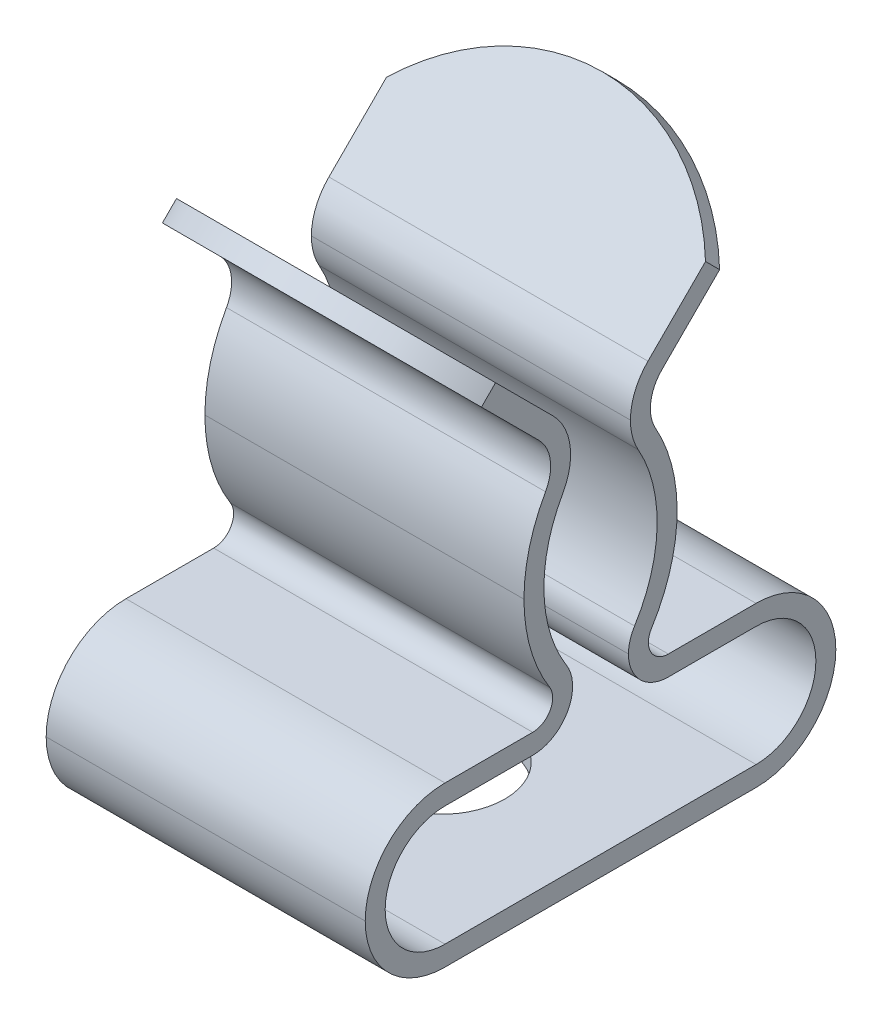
ISO-10303-21;
HEADER;
FILE_DESCRIPTION(('STEP AP214'),'2;1');
FILE_NAME('part.step','',(''),(''),'','','');
FILE_SCHEMA(('AUTOMOTIVE_DESIGN { 1 0 10303 214 1 1 1 1 }'));
ENDSEC;
DATA;
#1=APPLICATION_CONTEXT('core data for automotive mechanical design processes');
#2=APPLICATION_PROTOCOL_DEFINITION('international standard','automotive_design',2000,#1);
#3=PRODUCT_CONTEXT('',#1,'mechanical');
#4=PRODUCT('Part','Part','',(#3));
#5=PRODUCT_RELATED_PRODUCT_CATEGORY('part','',(#4));
#6=PRODUCT_DEFINITION_FORMATION('','',#4);
#7=PRODUCT_DEFINITION_CONTEXT('part definition',#1,'design');
#8=PRODUCT_DEFINITION('design','',#6,#7);
#9=PRODUCT_DEFINITION_SHAPE('','',#8);
#10=(LENGTH_UNIT() NAMED_UNIT(*) SI_UNIT(.MILLI.,.METRE.));
#11=(NAMED_UNIT(*) PLANE_ANGLE_UNIT() SI_UNIT($,.RADIAN.));
#12=(NAMED_UNIT(*) SI_UNIT($,.STERADIAN.) SOLID_ANGLE_UNIT());
#13=UNCERTAINTY_MEASURE_WITH_UNIT(LENGTH_MEASURE(1.E-05),#10,'distance_accuracy_value','');
#14=(GEOMETRIC_REPRESENTATION_CONTEXT(3) GLOBAL_UNCERTAINTY_ASSIGNED_CONTEXT((#13)) GLOBAL_UNIT_ASSIGNED_CONTEXT((#10,
#11,#12)) REPRESENTATION_CONTEXT('',''));
#15=CARTESIAN_POINT('',(0.,0.,0.));
#16=DIRECTION('',(0.,0.,1.));
#17=DIRECTION('',(1.,0.,0.));
#18=AXIS2_PLACEMENT_3D('',#15,#16,#17);
#19=CARTESIAN_POINT('',(17.3911017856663,15.2171733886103,17.2699844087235));
#20=DIRECTION('',(0.,-1.,0.));
#21=DIRECTION('',(-1.,0.,0.));
#22=AXIS2_PLACEMENT_3D('',#19,#20,#21);
#23=CYLINDRICAL_SURFACE('',#22,1.6);
#24=DIRECTION('',(0.,-1.,0.));
#25=VECTOR('',#24,1.);
#26=CARTESIAN_POINT('',(18.9911017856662,15.2171733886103,17.2699844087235));
#27=LINE('',#26,#25);
#28=CARTESIAN_POINT('',(18.9911017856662,15.7171733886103,17.2699844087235));
#29=VERTEX_POINT('',#28);
#30=CARTESIAN_POINT('',(18.9911017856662,15.2171733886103,17.2699844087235));
#31=VERTEX_POINT('',#30);
#32=EDGE_CURVE('E1331',#29,#31,#27,.T.);
#33=ORIENTED_EDGE('',*,*,#32,.F.);
#34=CARTESIAN_POINT('',(17.3911017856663,15.7171733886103,17.2699844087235));
#35=DIRECTION('',(0.,1.,0.));
#36=DIRECTION('',(1.,0.,0.));
#37=AXIS2_PLACEMENT_3D('',#34,#35,#36);
#38=CIRCLE('',#37,1.6);
#39=CARTESIAN_POINT('',(15.7911017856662,15.7171733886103,17.2699844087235));
#40=VERTEX_POINT('',#39);
#41=EDGE_CURVE('E698',#29,#40,#38,.T.);
#42=ORIENTED_EDGE('',*,*,#41,.T.);
#43=DIRECTION('',(0.,-1.,0.));
#44=VECTOR('',#43,1.);
#45=CARTESIAN_POINT('',(15.7911017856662,15.2171733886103,17.2699844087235));
#46=LINE('',#45,#44);
#47=CARTESIAN_POINT('',(15.7911017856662,15.2171733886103,17.2699844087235));
#48=VERTEX_POINT('',#47);
#49=EDGE_CURVE('E1267',#40,#48,#46,.T.);
#50=ORIENTED_EDGE('',*,*,#49,.T.);
#51=CARTESIAN_POINT('',(17.3911017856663,15.2171733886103,17.2699844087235));
#52=DIRECTION('',(0.,-1.,0.));
#53=DIRECTION('',(-1.,0.,0.));
#54=AXIS2_PLACEMENT_3D('',#51,#52,#53);
#55=CIRCLE('',#54,1.6);
#56=EDGE_CURVE('E558',#48,#31,#55,.T.);
#57=ORIENTED_EDGE('',*,*,#56,.T.);
#58=EDGE_LOOP('',(#33,#42,#50,#57));
#59=FACE_BOUND('',#58,.T.);
#60=ADVANCED_FACE('F15',(#59),#23,.F.);
#61=CARTESIAN_POINT('',(17.3911017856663,30.1259717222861,12.8076738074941));
#62=DIRECTION('',(0.,-0.70710678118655,0.707106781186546));
#63=DIRECTION('',(0.,-0.707106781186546,-0.70710678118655));
#64=AXIS2_PLACEMENT_3D('',#61,#62,#63);
#65=CYLINDRICAL_SURFACE('',#64,5.);
#66=CARTESIAN_POINT('',(17.3911017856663,25.1527484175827,17.7808971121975));
#67=DIRECTION('',(0.,-0.707106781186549,0.707106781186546));
#68=DIRECTION('',(0.,0.707106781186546,0.707106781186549));
#69=AXIS2_PLACEMENT_3D('',#66,#67,#68);
#70=CIRCLE('',#69,5.);
#71=CARTESIAN_POINT('',(21.3911017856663,27.2740687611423,19.9022174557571));
#72=VERTEX_POINT('',#71);
#73=CARTESIAN_POINT('',(13.3911017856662,27.2740687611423,19.9022174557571));
#74=VERTEX_POINT('',#73);
#75=EDGE_CURVE('E390',#72,#74,#70,.T.);
#76=ORIENTED_EDGE('',*,*,#75,.T.);
#77=DIRECTION('',(0.,-0.707106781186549,0.707106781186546));
#78=VECTOR('',#77,1.);
#79=CARTESIAN_POINT('',(13.3911017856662,32.2472920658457,14.9289941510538));
#80=LINE('',#79,#78);
#81=CARTESIAN_POINT('',(13.3911017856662,26.920515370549,20.2557708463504));
#82=VERTEX_POINT('',#81);
#83=EDGE_CURVE('E370',#74,#82,#80,.T.);
#84=ORIENTED_EDGE('',*,*,#83,.T.);
#85=CARTESIAN_POINT('',(17.3911017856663,24.7991950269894,18.1344505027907));
#86=DIRECTION('',(0.,0.70710678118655,-0.707106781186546));
#87=DIRECTION('',(0.,-0.707106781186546,-0.70710678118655));
#88=AXIS2_PLACEMENT_3D('',#85,#86,#87);
#89=CIRCLE('',#88,5.);
#90=CARTESIAN_POINT('',(21.3911017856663,26.920515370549,20.2557708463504));
#91=VERTEX_POINT('',#90);
#92=EDGE_CURVE('E421',#82,#91,#89,.T.);
#93=ORIENTED_EDGE('',*,*,#92,.T.);
#94=DIRECTION('',(0.,-0.707106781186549,0.707106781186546));
#95=VECTOR('',#94,1.);
#96=CARTESIAN_POINT('',(21.3911017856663,32.2472920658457,14.9289941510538));
#97=LINE('',#96,#95);
#98=EDGE_CURVE('E575',#72,#91,#97,.T.);
#99=ORIENTED_EDGE('',*,*,#98,.F.);
#100=EDGE_LOOP('',(#76,#84,#93,#99));
#101=FACE_BOUND('',#100,.T.);
#102=ADVANCED_FACE('F17',(#101),#65,.T.);
#103=CARTESIAN_POINT('',(17.3911017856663,30.1259717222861,21.7322950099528));
#104=DIRECTION('',(0.,-0.70710678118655,-0.707106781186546));
#105=DIRECTION('',(0.,0.707106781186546,-0.70710678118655));
#106=AXIS2_PLACEMENT_3D('',#103,#104,#105);
#107=CYLINDRICAL_SURFACE('',#106,5.);
#108=DIRECTION('',(0.,-0.707106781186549,-0.707106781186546));
#109=VECTOR('',#108,1.);
#110=CARTESIAN_POINT('',(17.3911017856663,33.6615056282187,18.1967611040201));
#111=LINE('',#110,#109);
#112=CARTESIAN_POINT('',(17.3911017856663,28.6882823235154,13.2235377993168));
#113=VERTEX_POINT('',#112);
#114=CARTESIAN_POINT('',(17.3911017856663,28.3347289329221,12.8699844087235));
#115=VERTEX_POINT('',#114);
#116=EDGE_CURVE('E1274',#113,#115,#111,.T.);
#117=ORIENTED_EDGE('',*,*,#116,.F.);
#118=CARTESIAN_POINT('',(17.3911017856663,25.1527484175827,16.7590717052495));
#119=DIRECTION('',(0.,-0.707106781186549,-0.707106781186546));
#120=DIRECTION('',(0.,-0.707106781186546,0.707106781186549));
#121=AXIS2_PLACEMENT_3D('',#118,#119,#120);
#122=CIRCLE('',#121,5.);
#123=CARTESIAN_POINT('',(21.3911017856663,27.2740687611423,14.6377513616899));
#124=VERTEX_POINT('',#123);
#125=EDGE_CURVE('E410',#113,#124,#122,.T.);
#126=ORIENTED_EDGE('',*,*,#125,.T.);
#127=DIRECTION('',(0.,-0.707106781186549,-0.707106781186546));
#128=VECTOR('',#127,1.);
#129=CARTESIAN_POINT('',(21.3911017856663,32.2472920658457,19.6109746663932));
#130=LINE('',#129,#128);
#131=CARTESIAN_POINT('',(21.3911017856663,26.920515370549,14.2841979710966));
#132=VERTEX_POINT('',#131);
#133=EDGE_CURVE('E482',#124,#132,#130,.T.);
#134=ORIENTED_EDGE('',*,*,#133,.T.);
#135=CARTESIAN_POINT('',(17.3911017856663,24.7991950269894,16.4055183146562));
#136=DIRECTION('',(0.,0.70710678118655,0.707106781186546));
#137=DIRECTION('',(0.,-0.707106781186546,0.70710678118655));
#138=AXIS2_PLACEMENT_3D('',#135,#136,#137);
#139=CIRCLE('',#138,5.);
#140=EDGE_CURVE('E659',#132,#115,#139,.T.);
#141=ORIENTED_EDGE('',*,*,#140,.T.);
#142=EDGE_LOOP('',(#117,#126,#134,#141));
#143=FACE_BOUND('',#142,.T.);
#144=ADVANCED_FACE('F810',(#143),#107,.T.);
#145=CARTESIAN_POINT('',(21.3911017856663,24.770515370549,15.0199844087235));
#146=DIRECTION('',(-1.,0.,0.));
#147=DIRECTION('',(0.,0.,1.));
#148=AXIS2_PLACEMENT_3D('',#145,#146,#147);
#149=CYLINDRICAL_SURFACE('',#148,1.);
#150=DIRECTION('',(-1.,0.,0.));
#151=VECTOR('',#150,1.);
#152=CARTESIAN_POINT('',(21.3911017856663,24.770515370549,16.0199844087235));
#153=LINE('',#152,#151);
#154=CARTESIAN_POINT('',(21.3911017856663,24.770515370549,16.0199844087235));
#155=VERTEX_POINT('',#154);
#156=CARTESIAN_POINT('',(13.3911017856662,24.770515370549,16.0199844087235));
#157=VERTEX_POINT('',#156);
#158=EDGE_CURVE('E1234',#155,#157,#153,.T.);
#159=ORIENTED_EDGE('',*,*,#158,.F.);
#160=CARTESIAN_POINT('',(21.3911017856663,24.770515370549,15.0199844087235));
#161=DIRECTION('',(-1.,0.,0.));
#162=DIRECTION('',(0.,0.,1.));
#163=AXIS2_PLACEMENT_3D('',#160,#161,#162);
#164=CIRCLE('',#163,1.);
#165=CARTESIAN_POINT('',(21.3911017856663,24.27948806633,15.8911285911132));
#166=VERTEX_POINT('',#165);
#167=EDGE_CURVE('E483',#166,#155,#164,.T.);
#168=ORIENTED_EDGE('',*,*,#167,.F.);
#169=DIRECTION('',(-1.,0.,0.));
#170=VECTOR('',#169,1.);
#171=CARTESIAN_POINT('',(21.3911017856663,24.27948806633,15.8911285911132));
#172=LINE('',#171,#170);
#173=CARTESIAN_POINT('',(13.3911017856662,24.27948806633,15.8911285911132));
#174=VERTEX_POINT('',#173);
#175=EDGE_CURVE('E10',#166,#174,#172,.T.);
#176=ORIENTED_EDGE('',*,*,#175,.T.);
#177=CARTESIAN_POINT('',(13.3911017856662,24.770515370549,15.0199844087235));
#178=DIRECTION('',(-1.,0.,0.));
#179=DIRECTION('',(0.,0.,1.));
#180=AXIS2_PLACEMENT_3D('',#177,#178,#179);
#181=CIRCLE('',#180,1.);
#182=EDGE_CURVE('E552',#174,#157,#181,.T.);
#183=ORIENTED_EDGE('',*,*,#182,.T.);
#184=EDGE_LOOP('',(#159,#168,#176,#183));
#185=FACE_BOUND('',#184,.T.);
#186=ADVANCED_FACE('F804',(#185),#149,.F.);
#187=CARTESIAN_POINT('',(21.3911017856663,22.2171733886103,19.54993415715));
#188=DIRECTION('',(-1.,0.,0.));
#189=DIRECTION('',(0.,0.,1.));
#190=AXIS2_PLACEMENT_3D('',#187,#188,#189);
#191=CYLINDRICAL_SURFACE('',#190,4.2);
#192=CARTESIAN_POINT('',(13.3911017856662,22.2171733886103,19.54993415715));
#193=DIRECTION('',(1.,0.,0.));
#194=DIRECTION('',(0.,0.,-1.));
#195=AXIS2_PLACEMENT_3D('',#192,#193,#194);
#196=CIRCLE('',#195,4.2);
#197=CARTESIAN_POINT('',(13.3911017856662,19.9831308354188,15.9933833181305));
#198=VERTEX_POINT('',#197);
#199=EDGE_CURVE('E548',#198,#174,#196,.T.);
#200=ORIENTED_EDGE('',*,*,#199,.T.);
#201=ORIENTED_EDGE('',*,*,#175,.F.);
#202=CARTESIAN_POINT('',(21.3911017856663,22.2171733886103,19.54993415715));
#203=DIRECTION('',(1.,0.,0.));
#204=DIRECTION('',(0.,0.,-1.));
#205=AXIS2_PLACEMENT_3D('',#202,#203,#204);
#206=CIRCLE('',#205,4.2);
#207=CARTESIAN_POINT('',(21.3911017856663,19.9831308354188,15.9933833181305));
#208=VERTEX_POINT('',#207);
#209=EDGE_CURVE('E474',#208,#166,#206,.T.);
#210=ORIENTED_EDGE('',*,*,#209,.F.);
#211=DIRECTION('',(-1.,0.,0.));
#212=VECTOR('',#211,1.);
#213=CARTESIAN_POINT('',(21.3911017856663,19.9831308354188,15.9933833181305));
#214=LINE('',#213,#212);
#215=EDGE_CURVE('E404',#208,#198,#214,.T.);
#216=ORIENTED_EDGE('',*,*,#215,.T.);
#217=EDGE_LOOP('',(#200,#201,#210,#216));
#218=FACE_BOUND('',#217,.T.);
#219=ADVANCED_FACE('F809',(#218),#191,.T.);
#220=CARTESIAN_POINT('',(21.3911017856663,19.7171733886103,15.5699844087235));
#221=DIRECTION('',(-1.,0.,0.));
#222=DIRECTION('',(0.,0.,1.));
#223=AXIS2_PLACEMENT_3D('',#220,#221,#222);
#224=CYLINDRICAL_SURFACE('',#223,0.5);
#225=DIRECTION('',(-1.,0.,0.));
#226=VECTOR('',#225,1.);
#227=CARTESIAN_POINT('',(21.3911017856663,19.7171733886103,16.0699844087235));
#228=LINE('',#227,#226);
#229=CARTESIAN_POINT('',(21.3911017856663,19.7171733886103,16.0699844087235));
#230=VERTEX_POINT('',#229);
#231=CARTESIAN_POINT('',(13.3911017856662,19.7171733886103,16.0699844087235));
#232=VERTEX_POINT('',#231);
#233=EDGE_CURVE('E399',#230,#232,#228,.T.);
#234=ORIENTED_EDGE('',*,*,#233,.F.);
#235=CARTESIAN_POINT('',(21.3911017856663,19.7171733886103,15.5699844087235));
#236=DIRECTION('',(-1.,0.,0.));
#237=DIRECTION('',(0.,0.,1.));
#238=AXIS2_PLACEMENT_3D('',#235,#236,#237);
#239=CIRCLE('',#238,0.5);
#240=CARTESIAN_POINT('',(21.3911017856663,19.2171733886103,15.5699844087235));
#241=VERTEX_POINT('',#240);
#242=EDGE_CURVE('E469',#241,#230,#239,.T.);
#243=ORIENTED_EDGE('',*,*,#242,.F.);
#244=DIRECTION('',(-1.,0.,0.));
#245=VECTOR('',#244,1.);
#246=CARTESIAN_POINT('',(21.3911017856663,19.2171733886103,15.5699844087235));
#247=LINE('',#246,#245);
#248=CARTESIAN_POINT('',(13.3911017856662,19.2171733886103,15.5699844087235));
#249=VERTEX_POINT('',#248);
#250=EDGE_CURVE('E25',#241,#249,#247,.T.);
#251=ORIENTED_EDGE('',*,*,#250,.T.);
#252=CARTESIAN_POINT('',(13.3911017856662,19.7171733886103,15.5699844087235));
#253=DIRECTION('',(-1.,0.,0.));
#254=DIRECTION('',(0.,0.,1.));
#255=AXIS2_PLACEMENT_3D('',#252,#253,#254);
#256=CIRCLE('',#255,0.5);
#257=EDGE_CURVE('E551',#249,#232,#256,.T.);
#258=ORIENTED_EDGE('',*,*,#257,.T.);
#259=EDGE_LOOP('',(#234,#243,#251,#258));
#260=FACE_BOUND('',#259,.T.);
#261=ADVANCED_FACE('F1080',(#260),#224,.F.);
#262=CARTESIAN_POINT('',(21.3911017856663,19.2171733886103,13.3699844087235));
#263=DIRECTION('',(0.,-1.,0.));
#264=DIRECTION('',(-1.,0.,0.));
#265=AXIS2_PLACEMENT_3D('',#262,#263,#264);
#266=PLANE('',#265);
#267=DIRECTION('',(0.,0.,1.));
#268=VECTOR('',#267,1.);
#269=CARTESIAN_POINT('',(13.3911017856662,19.2171733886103,13.3699844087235));
#270=LINE('',#269,#268);
#271=CARTESIAN_POINT('',(13.3911017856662,19.2171733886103,13.3699844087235));
#272=VERTEX_POINT('',#271);
#273=EDGE_CURVE('E645',#272,#249,#270,.T.);
#274=ORIENTED_EDGE('',*,*,#273,.T.);
#275=ORIENTED_EDGE('',*,*,#250,.F.);
#276=DIRECTION('',(0.,0.,1.));
#277=VECTOR('',#276,1.);
#278=CARTESIAN_POINT('',(21.3911017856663,19.2171733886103,13.3699844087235));
#279=LINE('',#278,#277);
#280=CARTESIAN_POINT('',(21.3911017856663,19.2171733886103,13.3699844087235));
#281=VERTEX_POINT('',#280);
#282=EDGE_CURVE('E459',#281,#241,#279,.T.);
#283=ORIENTED_EDGE('',*,*,#282,.F.);
#284=DIRECTION('',(-1.,0.,0.));
#285=VECTOR('',#284,1.);
#286=CARTESIAN_POINT('',(21.3911017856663,19.2171733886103,13.3699844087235));
#287=LINE('',#286,#285);
#288=EDGE_CURVE('E556',#281,#272,#287,.T.);
#289=ORIENTED_EDGE('',*,*,#288,.T.);
#290=EDGE_LOOP('',(#274,#275,#283,#289));
#291=FACE_BOUND('',#290,.T.);
#292=ADVANCED_FACE('F1070',(#291),#266,.F.);
#293=CARTESIAN_POINT('',(21.3911017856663,17.2171733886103,13.3699844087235));
#294=DIRECTION('',(-1.,0.,0.));
#295=DIRECTION('',(0.,0.,1.));
#296=AXIS2_PLACEMENT_3D('',#293,#294,#295);
#297=CYLINDRICAL_SURFACE('',#296,2.);
#298=CARTESIAN_POINT('',(13.3911017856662,17.2171733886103,13.3699844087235));
#299=DIRECTION('',(1.,0.,0.));
#300=DIRECTION('',(0.,0.,-1.));
#301=AXIS2_PLACEMENT_3D('',#298,#299,#300);
#302=CIRCLE('',#301,2.);
#303=CARTESIAN_POINT('',(13.3911017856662,15.2171733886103,13.3699844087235));
#304=VERTEX_POINT('',#303);
#305=EDGE_CURVE('E652',#304,#272,#302,.T.);
#306=ORIENTED_EDGE('',*,*,#305,.T.);
#307=ORIENTED_EDGE('',*,*,#288,.F.);
#308=CARTESIAN_POINT('',(21.3911017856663,17.2171733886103,13.3699844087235));
#309=DIRECTION('',(1.,0.,0.));
#310=DIRECTION('',(0.,0.,-1.));
#311=AXIS2_PLACEMENT_3D('',#308,#309,#310);
#312=CIRCLE('',#311,2.);
#313=CARTESIAN_POINT('',(21.3911017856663,15.2171733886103,13.3699844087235));
#314=VERTEX_POINT('',#313);
#315=EDGE_CURVE('E455',#314,#281,#312,.T.);
#316=ORIENTED_EDGE('',*,*,#315,.F.);
#317=DIRECTION('',(-1.,0.,0.));
#318=VECTOR('',#317,1.);
#319=CARTESIAN_POINT('',(21.3911017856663,15.2171733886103,13.3699844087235));
#320=LINE('',#319,#318);
#321=EDGE_CURVE('E597',#314,#304,#320,.T.);
#322=ORIENTED_EDGE('',*,*,#321,.T.);
#323=EDGE_LOOP('',(#306,#307,#316,#322));
#324=FACE_BOUND('',#323,.T.);
#325=ADVANCED_FACE('F1060',(#324),#297,.T.);
#326=CARTESIAN_POINT('',(21.3911017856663,15.2171733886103,13.3699844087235));
#327=DIRECTION('',(0.,1.,0.));
#328=DIRECTION('',(0.,0.,-1.));
#329=AXIS2_PLACEMENT_3D('',#326,#327,#328);
#330=PLANE('',#329);
#331=ORIENTED_EDGE('',*,*,#56,.F.);
#332=CARTESIAN_POINT('',(17.3911017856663,15.2171733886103,17.2699844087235));
#333=DIRECTION('',(0.,-1.,0.));
#334=DIRECTION('',(-1.,0.,0.));
#335=AXIS2_PLACEMENT_3D('',#332,#333,#334);
#336=CIRCLE('',#335,1.6);
#337=EDGE_CURVE('E1266',#31,#48,#336,.T.);
#338=ORIENTED_EDGE('',*,*,#337,.F.);
#339=EDGE_LOOP('',(#331,#338));
#340=FACE_BOUND('',#339,.T.);
#341=DIRECTION('',(0.,0.,-1.));
#342=VECTOR('',#341,1.);
#343=CARTESIAN_POINT('',(13.3911017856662,15.2171733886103,13.3699844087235));
#344=LINE('',#343,#342);
#345=CARTESIAN_POINT('',(13.3911017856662,15.2171733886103,21.1699844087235));
#346=VERTEX_POINT('',#345);
#347=EDGE_CURVE('E682',#346,#304,#344,.T.);
#348=ORIENTED_EDGE('',*,*,#347,.T.);
#349=ORIENTED_EDGE('',*,*,#321,.F.);
#350=DIRECTION('',(0.,0.,-1.));
#351=VECTOR('',#350,1.);
#352=CARTESIAN_POINT('',(21.3911017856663,15.2171733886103,13.3699844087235));
#353=LINE('',#352,#351);
#354=CARTESIAN_POINT('',(21.3911017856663,15.2171733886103,21.1699844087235));
#355=VERTEX_POINT('',#354);
#356=EDGE_CURVE('E460',#355,#314,#353,.T.);
#357=ORIENTED_EDGE('',*,*,#356,.F.);
#358=DIRECTION('',(-1.,0.,0.));
#359=VECTOR('',#358,1.);
#360=CARTESIAN_POINT('',(21.3911017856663,15.2171733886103,21.1699844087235));
#361=LINE('',#360,#359);
#362=EDGE_CURVE('E429',#355,#346,#361,.T.);
#363=ORIENTED_EDGE('',*,*,#362,.T.);
#364=EDGE_LOOP('',(#348,#349,#357,#363));
#365=FACE_BOUND('',#364,.T.);
#366=ADVANCED_FACE('F1050',(#340,#365),#330,.F.);
#367=CARTESIAN_POINT('',(21.3911017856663,17.2171733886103,21.1699844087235));
#368=DIRECTION('',(-1.,0.,0.));
#369=DIRECTION('',(0.,0.,1.));
#370=AXIS2_PLACEMENT_3D('',#367,#368,#369);
#371=CYLINDRICAL_SURFACE('',#370,2.);
#372=DIRECTION('',(-1.,0.,0.));
#373=VECTOR('',#372,1.);
#374=CARTESIAN_POINT('',(21.3911017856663,17.2171733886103,23.1699844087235));
#375=LINE('',#374,#373);
#376=CARTESIAN_POINT('',(21.3911017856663,17.2171733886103,23.1699844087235));
#377=VERTEX_POINT('',#376);
#378=CARTESIAN_POINT('',(13.3911017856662,17.2171733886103,23.1699844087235));
#379=VERTEX_POINT('',#378);
#380=EDGE_CURVE('E417',#377,#379,#375,.T.);
#381=ORIENTED_EDGE('',*,*,#380,.F.);
#382=CARTESIAN_POINT('',(21.3911017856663,17.2171733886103,21.1699844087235));
#383=DIRECTION('',(1.,0.,0.));
#384=DIRECTION('',(0.,0.,1.));
#385=AXIS2_PLACEMENT_3D('',#382,#383,#384);
#386=CIRCLE('',#385,2.);
#387=CARTESIAN_POINT('',(21.3911017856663,19.2171733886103,21.1699844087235));
#388=VERTEX_POINT('',#387);
#389=EDGE_CURVE('E596',#388,#377,#386,.T.);
#390=ORIENTED_EDGE('',*,*,#389,.F.);
#391=DIRECTION('',(-1.,0.,0.));
#392=VECTOR('',#391,1.);
#393=CARTESIAN_POINT('',(21.3911017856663,19.2171733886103,21.1699844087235));
#394=LINE('',#393,#392);
#395=CARTESIAN_POINT('',(13.3911017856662,19.2171733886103,21.1699844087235));
#396=VERTEX_POINT('',#395);
#397=EDGE_CURVE('E600',#388,#396,#394,.T.);
#398=ORIENTED_EDGE('',*,*,#397,.T.);
#399=CARTESIAN_POINT('',(13.3911017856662,17.2171733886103,21.1699844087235));
#400=DIRECTION('',(1.,0.,0.));
#401=DIRECTION('',(0.,0.,1.));
#402=AXIS2_PLACEMENT_3D('',#399,#400,#401);
#403=CIRCLE('',#402,2.);
#404=EDGE_CURVE('E686',#396,#379,#403,.T.);
#405=ORIENTED_EDGE('',*,*,#404,.T.);
#406=EDGE_LOOP('',(#381,#390,#398,#405));
#407=FACE_BOUND('',#406,.T.);
#408=ADVANCED_FACE('F1040',(#407),#371,.T.);
#409=CARTESIAN_POINT('',(21.3911017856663,19.2171733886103,21.1699844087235));
#410=DIRECTION('',(0.,-1.,0.));
#411=DIRECTION('',(0.,0.,1.));
#412=AXIS2_PLACEMENT_3D('',#409,#410,#411);
#413=PLANE('',#412);
#414=DIRECTION('',(0.,0.,1.));
#415=VECTOR('',#414,1.);
#416=CARTESIAN_POINT('',(13.3911017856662,19.2171733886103,21.1699844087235));
#417=LINE('',#416,#415);
#418=CARTESIAN_POINT('',(13.3911017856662,19.2171733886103,18.9699844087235));
#419=VERTEX_POINT('',#418);
#420=EDGE_CURVE('E635',#419,#396,#417,.T.);
#421=ORIENTED_EDGE('',*,*,#420,.T.);
#422=ORIENTED_EDGE('',*,*,#397,.F.);
#423=DIRECTION('',(0.,0.,1.));
#424=VECTOR('',#423,1.);
#425=CARTESIAN_POINT('',(21.3911017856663,19.2171733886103,21.1699844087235));
#426=LINE('',#425,#424);
#427=CARTESIAN_POINT('',(21.3911017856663,19.2171733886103,18.9699844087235));
#428=VERTEX_POINT('',#427);
#429=EDGE_CURVE('E592',#428,#388,#426,.T.);
#430=ORIENTED_EDGE('',*,*,#429,.F.);
#431=DIRECTION('',(-1.,0.,0.));
#432=VECTOR('',#431,1.);
#433=CARTESIAN_POINT('',(21.3911017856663,19.2171733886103,18.9699844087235));
#434=LINE('',#433,#432);
#435=EDGE_CURVE('E530',#428,#419,#434,.T.);
#436=ORIENTED_EDGE('',*,*,#435,.T.);
#437=EDGE_LOOP('',(#421,#422,#430,#436));
#438=FACE_BOUND('',#437,.T.);
#439=ADVANCED_FACE('F1030',(#438),#413,.F.);
#440=CARTESIAN_POINT('',(21.3911017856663,19.7171733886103,18.9699844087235));
#441=DIRECTION('',(-1.,0.,0.));
#442=DIRECTION('',(0.,0.,1.));
#443=AXIS2_PLACEMENT_3D('',#440,#441,#442);
#444=CYLINDRICAL_SURFACE('',#443,0.5);
#445=CARTESIAN_POINT('',(13.3911017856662,19.7171733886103,18.9699844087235));
#446=DIRECTION('',(-1.,0.,0.));
#447=DIRECTION('',(0.,0.,-1.));
#448=AXIS2_PLACEMENT_3D('',#445,#446,#447);
#449=CIRCLE('',#448,0.5);
#450=CARTESIAN_POINT('',(13.3911017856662,19.9831308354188,18.5465854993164));
#451=VERTEX_POINT('',#450);
#452=EDGE_CURVE('E631',#451,#419,#449,.T.);
#453=ORIENTED_EDGE('',*,*,#452,.T.);
#454=ORIENTED_EDGE('',*,*,#435,.F.);
#455=CARTESIAN_POINT('',(21.3911017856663,19.7171733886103,18.9699844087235));
#456=DIRECTION('',(-1.,0.,0.));
#457=DIRECTION('',(0.,0.,-1.));
#458=AXIS2_PLACEMENT_3D('',#455,#456,#457);
#459=CIRCLE('',#458,0.5);
#460=CARTESIAN_POINT('',(21.3911017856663,19.9831308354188,18.5465854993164));
#461=VERTEX_POINT('',#460);
#462=EDGE_CURVE('E441',#461,#428,#459,.T.);
#463=ORIENTED_EDGE('',*,*,#462,.F.);
#464=DIRECTION('',(-1.,0.,0.));
#465=VECTOR('',#464,1.);
#466=CARTESIAN_POINT('',(21.3911017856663,19.9831308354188,18.5465854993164));
#467=LINE('',#466,#465);
#468=EDGE_CURVE('E450',#461,#451,#467,.T.);
#469=ORIENTED_EDGE('',*,*,#468,.T.);
#470=EDGE_LOOP('',(#453,#454,#463,#469));
#471=FACE_BOUND('',#470,.T.);
#472=ADVANCED_FACE('F1021',(#471),#444,.F.);
#473=CARTESIAN_POINT('',(21.3911017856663,22.2171733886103,14.990034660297));
#474=DIRECTION('',(-1.,0.,0.));
#475=DIRECTION('',(0.,0.,1.));
#476=AXIS2_PLACEMENT_3D('',#473,#474,#475);
#477=CYLINDRICAL_SURFACE('',#476,4.2);
#478=DIRECTION('',(-1.,0.,0.));
#479=VECTOR('',#478,1.);
#480=CARTESIAN_POINT('',(21.3911017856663,22.2171733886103,19.190034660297));
#481=LINE('',#480,#479);
#482=CARTESIAN_POINT('',(21.3911017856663,22.2171733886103,19.190034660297));
#483=VERTEX_POINT('',#482);
#484=CARTESIAN_POINT('',(13.3911017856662,22.2171733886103,19.190034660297));
#485=VERTEX_POINT('',#484);
#486=EDGE_CURVE('E437',#483,#485,#481,.T.);
#487=ORIENTED_EDGE('',*,*,#486,.F.);
#488=CARTESIAN_POINT('',(21.3911017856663,22.2171733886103,14.990034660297));
#489=DIRECTION('',(1.,0.,0.));
#490=DIRECTION('',(0.,0.,1.));
#491=AXIS2_PLACEMENT_3D('',#488,#489,#490);
#492=CIRCLE('',#491,4.2);
#493=CARTESIAN_POINT('',(21.3911017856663,24.27948806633,18.6488402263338));
#494=VERTEX_POINT('',#493);
#495=EDGE_CURVE('E438',#494,#483,#492,.T.);
#496=ORIENTED_EDGE('',*,*,#495,.F.);
#497=DIRECTION('',(-1.,0.,0.));
#498=VECTOR('',#497,1.);
#499=CARTESIAN_POINT('',(21.3911017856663,24.27948806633,18.6488402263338));
#500=LINE('',#499,#498);
#501=CARTESIAN_POINT('',(13.3911017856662,24.27948806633,18.6488402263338));
#502=VERTEX_POINT('',#501);
#503=EDGE_CURVE('E37',#494,#502,#500,.T.);
#504=ORIENTED_EDGE('',*,*,#503,.T.);
#505=CARTESIAN_POINT('',(13.3911017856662,22.2171733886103,14.990034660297));
#506=DIRECTION('',(1.,0.,0.));
#507=DIRECTION('',(0.,0.,1.));
#508=AXIS2_PLACEMENT_3D('',#505,#506,#507);
#509=CIRCLE('',#508,4.2);
#510=EDGE_CURVE('E623',#502,#485,#509,.T.);
#511=ORIENTED_EDGE('',*,*,#510,.T.);
#512=EDGE_LOOP('',(#487,#496,#504,#511));
#513=FACE_BOUND('',#512,.T.);
#514=ADVANCED_FACE('F1011',(#513),#477,.T.);
#515=CARTESIAN_POINT('',(21.3911017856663,24.770515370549,19.5199844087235));
#516=DIRECTION('',(-1.,0.,0.));
#517=DIRECTION('',(0.,0.,1.));
#518=AXIS2_PLACEMENT_3D('',#515,#516,#517);
#519=CYLINDRICAL_SURFACE('',#518,1.);
#520=CARTESIAN_POINT('',(13.3911017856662,24.770515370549,19.5199844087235));
#521=DIRECTION('',(-1.,0.,0.));
#522=DIRECTION('',(0.,0.,-1.));
#523=AXIS2_PLACEMENT_3D('',#520,#521,#522);
#524=CIRCLE('',#523,1.);
#525=CARTESIAN_POINT('',(13.3911017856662,25.4776221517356,18.812877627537));
#526=VERTEX_POINT('',#525);
#527=EDGE_CURVE('E619',#526,#502,#524,.T.);
#528=ORIENTED_EDGE('',*,*,#527,.T.);
#529=ORIENTED_EDGE('',*,*,#503,.F.);
#530=CARTESIAN_POINT('',(21.3911017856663,24.770515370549,19.5199844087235));
#531=DIRECTION('',(-1.,0.,0.));
#532=DIRECTION('',(0.,0.,-1.));
#533=AXIS2_PLACEMENT_3D('',#530,#531,#532);
#534=CIRCLE('',#533,1.);
#535=CARTESIAN_POINT('',(21.3911017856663,25.4776221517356,18.812877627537));
#536=VERTEX_POINT('',#535);
#537=EDGE_CURVE('E442',#536,#494,#534,.T.);
#538=ORIENTED_EDGE('',*,*,#537,.F.);
#539=DIRECTION('',(-1.,0.,0.));
#540=VECTOR('',#539,1.);
#541=CARTESIAN_POINT('',(21.3911017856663,25.4776221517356,18.812877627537));
#542=LINE('',#541,#540);
#543=EDGE_CURVE('E571',#536,#526,#542,.T.);
#544=ORIENTED_EDGE('',*,*,#543,.T.);
#545=EDGE_LOOP('',(#528,#529,#538,#544));
#546=FACE_BOUND('',#545,.T.);
#547=ADVANCED_FACE('F1002',(#546),#519,.F.);
#548=CARTESIAN_POINT('',(21.3911017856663,24.770515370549,19.5199844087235));
#549=DIRECTION('',(-1.,0.,0.));
#550=DIRECTION('',(0.,0.,1.));
#551=AXIS2_PLACEMENT_3D('',#548,#549,#550);
#552=CYLINDRICAL_SURFACE('',#551,1.5);
#553=CARTESIAN_POINT('',(13.3911017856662,24.770515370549,19.5199844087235));
#554=DIRECTION('',(-1.,0.,0.));
#555=DIRECTION('',(0.,0.,-1.));
#556=AXIS2_PLACEMENT_3D('',#553,#554,#555);
#557=CIRCLE('',#556,1.5);
#558=CARTESIAN_POINT('',(13.3911017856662,25.8311755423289,18.4593242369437));
#559=VERTEX_POINT('',#558);
#560=CARTESIAN_POINT('',(13.3911017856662,24.0339744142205,18.2132681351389));
#561=VERTEX_POINT('',#560);
#562=EDGE_CURVE('E357',#559,#561,#557,.T.);
#563=ORIENTED_EDGE('',*,*,#562,.F.);
#564=DIRECTION('',(-1.,0.,0.));
#565=VECTOR('',#564,1.);
#566=CARTESIAN_POINT('',(21.3911017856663,25.8311755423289,18.4593242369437));
#567=LINE('',#566,#565);
#568=CARTESIAN_POINT('',(21.3911017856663,25.8311755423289,18.4593242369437));
#569=VERTEX_POINT('',#568);
#570=EDGE_CURVE('E361',#569,#559,#567,.T.);
#571=ORIENTED_EDGE('',*,*,#570,.F.);
#572=CARTESIAN_POINT('',(21.3911017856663,24.770515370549,19.5199844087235));
#573=DIRECTION('',(-1.,0.,0.));
#574=DIRECTION('',(0.,0.,-1.));
#575=AXIS2_PLACEMENT_3D('',#572,#573,#574);
#576=CIRCLE('',#575,1.5);
#577=CARTESIAN_POINT('',(21.3911017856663,24.0339744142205,18.2132681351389));
#578=VERTEX_POINT('',#577);
#579=EDGE_CURVE('E351',#569,#578,#576,.T.);
#580=ORIENTED_EDGE('',*,*,#579,.T.);
#581=DIRECTION('',(-1.,0.,0.));
#582=VECTOR('',#581,1.);
#583=CARTESIAN_POINT('',(21.3911017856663,24.0339744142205,18.2132681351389));
#584=LINE('',#583,#582);
#585=EDGE_CURVE('E364',#578,#561,#584,.T.);
#586=ORIENTED_EDGE('',*,*,#585,.T.);
#587=EDGE_LOOP('',(#563,#571,#580,#586));
#588=FACE_BOUND('',#587,.T.);
#589=ADVANCED_FACE('F359',(#588),#552,.T.);
#590=CARTESIAN_POINT('',(21.3911017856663,22.2171733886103,14.990034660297));
#591=DIRECTION('',(-1.,0.,0.));
#592=DIRECTION('',(0.,0.,1.));
#593=AXIS2_PLACEMENT_3D('',#590,#591,#592);
#594=CYLINDRICAL_SURFACE('',#593,3.7);
#595=DIRECTION('',(-1.,0.,0.));
#596=VECTOR('',#595,1.);
#597=CARTESIAN_POINT('',(21.3911017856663,22.2171733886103,18.690034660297));
#598=LINE('',#597,#596);
#599=CARTESIAN_POINT('',(21.3911017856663,22.2171733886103,18.690034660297));
#600=VERTEX_POINT('',#599);
#601=CARTESIAN_POINT('',(13.3911017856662,22.2171733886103,18.690034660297));
#602=VERTEX_POINT('',#601);
#603=EDGE_CURVE('E461',#600,#602,#598,.T.);
#604=ORIENTED_EDGE('',*,*,#603,.F.);
#605=CARTESIAN_POINT('',(21.3911017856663,22.2171733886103,14.990034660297));
#606=DIRECTION('',(1.,0.,0.));
#607=DIRECTION('',(0.,0.,-1.));
#608=AXIS2_PLACEMENT_3D('',#605,#606,#607);
#609=CIRCLE('',#608,3.7);
#610=CARTESIAN_POINT('',(21.3911017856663,20.2490882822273,18.1231865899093));
#611=VERTEX_POINT('',#610);
#612=EDGE_CURVE('E649',#600,#611,#609,.T.);
#613=ORIENTED_EDGE('',*,*,#612,.T.);
#614=DIRECTION('',(-1.,0.,0.));
#615=VECTOR('',#614,1.);
#616=CARTESIAN_POINT('',(21.3911017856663,20.2490882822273,18.1231865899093));
#617=LINE('',#616,#615);
#618=CARTESIAN_POINT('',(13.3911017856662,20.2490882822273,18.1231865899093));
#619=VERTEX_POINT('',#618);
#620=EDGE_CURVE('E531',#611,#619,#617,.T.);
#621=ORIENTED_EDGE('',*,*,#620,.T.);
#622=CARTESIAN_POINT('',(13.3911017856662,22.2171733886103,14.990034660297));
#623=DIRECTION('',(1.,0.,0.));
#624=DIRECTION('',(0.,0.,-1.));
#625=AXIS2_PLACEMENT_3D('',#622,#623,#624);
#626=CIRCLE('',#625,3.7);
#627=EDGE_CURVE('E369',#602,#619,#626,.T.);
#628=ORIENTED_EDGE('',*,*,#627,.F.);
#629=EDGE_LOOP('',(#604,#613,#621,#628));
#630=FACE_BOUND('',#629,.T.);
#631=ADVANCED_FACE('F983',(#630),#594,.F.);
#632=CARTESIAN_POINT('',(21.3911017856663,19.7171733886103,18.9699844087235));
#633=DIRECTION('',(-1.,0.,0.));
#634=DIRECTION('',(0.,0.,1.));
#635=AXIS2_PLACEMENT_3D('',#632,#633,#634);
#636=CYLINDRICAL_SURFACE('',#635,1.);
#637=CARTESIAN_POINT('',(13.3911017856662,19.7171733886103,18.9699844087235));
#638=DIRECTION('',(-1.,0.,0.));
#639=DIRECTION('',(0.,0.,-1.));
#640=AXIS2_PLACEMENT_3D('',#637,#638,#639);
#641=CIRCLE('',#640,1.);
#642=CARTESIAN_POINT('',(13.3911017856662,18.7171733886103,18.9699844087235));
#643=VERTEX_POINT('',#642);
#644=EDGE_CURVE('E581',#619,#643,#641,.T.);
#645=ORIENTED_EDGE('',*,*,#644,.F.);
#646=ORIENTED_EDGE('',*,*,#620,.F.);
#647=CARTESIAN_POINT('',(21.3911017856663,19.7171733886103,18.9699844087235));
#648=DIRECTION('',(-1.,0.,0.));
#649=DIRECTION('',(0.,0.,-1.));
#650=AXIS2_PLACEMENT_3D('',#647,#648,#649);
#651=CIRCLE('',#650,1.);
#652=CARTESIAN_POINT('',(21.3911017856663,18.7171733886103,18.9699844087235));
#653=VERTEX_POINT('',#652);
#654=EDGE_CURVE('E642',#611,#653,#651,.T.);
#655=ORIENTED_EDGE('',*,*,#654,.T.);
#656=DIRECTION('',(-1.,0.,0.));
#657=VECTOR('',#656,1.);
#658=CARTESIAN_POINT('',(21.3911017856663,18.7171733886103,18.9699844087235));
#659=LINE('',#658,#657);
#660=EDGE_CURVE('E702',#653,#643,#659,.T.);
#661=ORIENTED_EDGE('',*,*,#660,.T.);
#662=EDGE_LOOP('',(#645,#646,#655,#661));
#663=FACE_BOUND('',#662,.T.);
#664=ADVANCED_FACE('F973',(#663),#636,.T.);
#665=CARTESIAN_POINT('',(21.3911017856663,18.7171733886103,21.1699844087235));
#666=DIRECTION('',(0.,-1.,0.));
#667=DIRECTION('',(0.,0.,1.));
#668=AXIS2_PLACEMENT_3D('',#665,#666,#667);
#669=PLANE('',#668);
#670=DIRECTION('',(0.,0.,1.));
#671=VECTOR('',#670,1.);
#672=CARTESIAN_POINT('',(13.3911017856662,18.7171733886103,21.1699844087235));
#673=LINE('',#672,#671);
#674=CARTESIAN_POINT('',(13.3911017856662,18.7171733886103,21.1699844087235));
#675=VERTEX_POINT('',#674);
#676=EDGE_CURVE('E585',#643,#675,#673,.T.);
#677=ORIENTED_EDGE('',*,*,#676,.F.);
#678=ORIENTED_EDGE('',*,*,#660,.F.);
#679=DIRECTION('',(0.,0.,1.));
#680=VECTOR('',#679,1.);
#681=CARTESIAN_POINT('',(21.3911017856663,18.7171733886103,21.1699844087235));
#682=LINE('',#681,#680);
#683=CARTESIAN_POINT('',(21.3911017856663,18.7171733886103,21.1699844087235));
#684=VERTEX_POINT('',#683);
#685=EDGE_CURVE('E639',#653,#684,#682,.T.);
#686=ORIENTED_EDGE('',*,*,#685,.T.);
#687=DIRECTION('',(-1.,0.,0.));
#688=VECTOR('',#687,1.);
#689=CARTESIAN_POINT('',(21.3911017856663,18.7171733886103,21.1699844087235));
#690=LINE('',#689,#688);
#691=EDGE_CURVE('E496',#684,#675,#690,.T.);
#692=ORIENTED_EDGE('',*,*,#691,.T.);
#693=EDGE_LOOP('',(#677,#678,#686,#692));
#694=FACE_BOUND('',#693,.T.);
#695=ADVANCED_FACE('F963',(#694),#669,.T.);
#696=CARTESIAN_POINT('',(21.3911017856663,17.2171733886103,21.1699844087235));
#697=DIRECTION('',(-1.,0.,0.));
#698=DIRECTION('',(0.,0.,1.));
#699=AXIS2_PLACEMENT_3D('',#696,#697,#698);
#700=CYLINDRICAL_SURFACE('',#699,1.5);
#701=DIRECTION('',(-1.,0.,0.));
#702=VECTOR('',#701,1.);
#703=CARTESIAN_POINT('',(21.3911017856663,17.2171733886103,22.6699844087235));
#704=LINE('',#703,#702);
#705=CARTESIAN_POINT('',(21.3911017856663,17.2171733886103,22.6699844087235));
#706=VERTEX_POINT('',#705);
#707=CARTESIAN_POINT('',(13.3911017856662,17.2171733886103,22.6699844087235));
#708=VERTEX_POINT('',#707);
#709=EDGE_CURVE('E484',#706,#708,#704,.T.);
#710=ORIENTED_EDGE('',*,*,#709,.F.);
#711=CARTESIAN_POINT('',(21.3911017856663,17.2171733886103,21.1699844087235));
#712=DIRECTION('',(1.,0.,0.));
#713=DIRECTION('',(0.,0.,-1.));
#714=AXIS2_PLACEMENT_3D('',#711,#712,#713);
#715=CIRCLE('',#714,1.5);
#716=CARTESIAN_POINT('',(21.3911017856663,15.7171733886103,21.1699844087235));
#717=VERTEX_POINT('',#716);
#718=EDGE_CURVE('E630',#706,#717,#715,.T.);
#719=ORIENTED_EDGE('',*,*,#718,.T.);
#720=DIRECTION('',(-1.,0.,0.));
#721=VECTOR('',#720,1.);
#722=CARTESIAN_POINT('',(21.3911017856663,15.7171733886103,21.1699844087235));
#723=LINE('',#722,#721);
#724=CARTESIAN_POINT('',(13.3911017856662,15.7171733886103,21.1699844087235));
#725=VERTEX_POINT('',#724);
#726=EDGE_CURVE('E695',#717,#725,#723,.T.);
#727=ORIENTED_EDGE('',*,*,#726,.T.);
#728=CARTESIAN_POINT('',(13.3911017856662,17.2171733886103,21.1699844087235));
#729=DIRECTION('',(1.,0.,0.));
#730=DIRECTION('',(0.,0.,-1.));
#731=AXIS2_PLACEMENT_3D('',#728,#729,#730);
#732=CIRCLE('',#731,1.5);
#733=EDGE_CURVE('E510',#708,#725,#732,.T.);
#734=ORIENTED_EDGE('',*,*,#733,.F.);
#735=EDGE_LOOP('',(#710,#719,#727,#734));
#736=FACE_BOUND('',#735,.T.);
#737=ADVANCED_FACE('F953',(#736),#700,.F.);
#738=CARTESIAN_POINT('',(21.3911017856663,15.7171733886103,13.3699844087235));
#739=DIRECTION('',(0.,1.,0.));
#740=DIRECTION('',(0.,0.,-1.));
#741=AXIS2_PLACEMENT_3D('',#738,#739,#740);
#742=PLANE('',#741);
#743=CARTESIAN_POINT('',(17.3911017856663,15.7171733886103,17.2699844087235));
#744=DIRECTION('',(0.,1.,0.));
#745=DIRECTION('',(1.,0.,0.));
#746=AXIS2_PLACEMENT_3D('',#743,#744,#745);
#747=CIRCLE('',#746,1.6);
#748=EDGE_CURVE('E1335',#40,#29,#747,.T.);
#749=ORIENTED_EDGE('',*,*,#748,.F.);
#750=ORIENTED_EDGE('',*,*,#41,.F.);
#751=EDGE_LOOP('',(#749,#750));
#752=FACE_BOUND('',#751,.T.);
#753=DIRECTION('',(0.,0.,-1.));
#754=VECTOR('',#753,1.);
#755=CARTESIAN_POINT('',(13.3911017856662,15.7171733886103,13.3699844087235));
#756=LINE('',#755,#754);
#757=CARTESIAN_POINT('',(13.3911017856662,15.7171733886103,13.3699844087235));
#758=VERTEX_POINT('',#757);
#759=EDGE_CURVE('E505',#725,#758,#756,.T.);
#760=ORIENTED_EDGE('',*,*,#759,.F.);
#761=ORIENTED_EDGE('',*,*,#726,.F.);
#762=DIRECTION('',(0.,0.,-1.));
#763=VECTOR('',#762,1.);
#764=CARTESIAN_POINT('',(21.3911017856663,15.7171733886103,13.3699844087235));
#765=LINE('',#764,#763);
#766=CARTESIAN_POINT('',(21.3911017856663,15.7171733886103,13.3699844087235));
#767=VERTEX_POINT('',#766);
#768=EDGE_CURVE('E535',#717,#767,#765,.T.);
#769=ORIENTED_EDGE('',*,*,#768,.T.);
#770=DIRECTION('',(-1.,0.,0.));
#771=VECTOR('',#770,1.);
#772=CARTESIAN_POINT('',(21.3911017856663,15.7171733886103,13.3699844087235));
#773=LINE('',#772,#771);
#774=EDGE_CURVE('E699',#767,#758,#773,.T.);
#775=ORIENTED_EDGE('',*,*,#774,.T.);
#776=EDGE_LOOP('',(#760,#761,#769,#775));
#777=FACE_BOUND('',#776,.T.);
#778=ADVANCED_FACE('F943',(#752,#777),#742,.T.);
#779=CARTESIAN_POINT('',(21.3911017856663,17.2171733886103,13.3699844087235));
#780=DIRECTION('',(-1.,0.,0.));
#781=DIRECTION('',(0.,0.,1.));
#782=AXIS2_PLACEMENT_3D('',#779,#780,#781);
#783=CYLINDRICAL_SURFACE('',#782,1.5);
#784=CARTESIAN_POINT('',(13.3911017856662,17.2171733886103,13.3699844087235));
#785=DIRECTION('',(1.,0.,0.));
#786=DIRECTION('',(0.,0.,-1.));
#787=AXIS2_PLACEMENT_3D('',#784,#785,#786);
#788=CIRCLE('',#787,1.5);
#789=CARTESIAN_POINT('',(13.3911017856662,18.7171733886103,13.3699844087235));
#790=VERTEX_POINT('',#789);
#791=EDGE_CURVE('E509',#758,#790,#788,.T.);
#792=ORIENTED_EDGE('',*,*,#791,.F.);
#793=ORIENTED_EDGE('',*,*,#774,.F.);
#794=CARTESIAN_POINT('',(21.3911017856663,17.2171733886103,13.3699844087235));
#795=DIRECTION('',(1.,0.,0.));
#796=DIRECTION('',(0.,0.,-1.));
#797=AXIS2_PLACEMENT_3D('',#794,#795,#796);
#798=CIRCLE('',#797,1.5);
#799=CARTESIAN_POINT('',(21.3911017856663,18.7171733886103,13.3699844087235));
#800=VERTEX_POINT('',#799);
#801=EDGE_CURVE('E522',#767,#800,#798,.T.);
#802=ORIENTED_EDGE('',*,*,#801,.T.);
#803=DIRECTION('',(-1.,0.,0.));
#804=VECTOR('',#803,1.);
#805=CARTESIAN_POINT('',(21.3911017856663,18.7171733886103,13.3699844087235));
#806=LINE('',#805,#804);
#807=EDGE_CURVE('E694',#800,#790,#806,.T.);
#808=ORIENTED_EDGE('',*,*,#807,.T.);
#809=EDGE_LOOP('',(#792,#793,#802,#808));
#810=FACE_BOUND('',#809,.T.);
#811=ADVANCED_FACE('F933',(#810),#783,.F.);
#812=CARTESIAN_POINT('',(21.3911017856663,18.7171733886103,13.3699844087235));
#813=DIRECTION('',(0.,-1.,0.));
#814=DIRECTION('',(-1.,0.,0.));
#815=AXIS2_PLACEMENT_3D('',#812,#813,#814);
#816=PLANE('',#815);
#817=DIRECTION('',(0.,0.,1.));
#818=VECTOR('',#817,1.);
#819=CARTESIAN_POINT('',(13.3911017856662,18.7171733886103,13.3699844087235));
#820=LINE('',#819,#818);
#821=CARTESIAN_POINT('',(13.3911017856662,18.7171733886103,15.5699844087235));
#822=VERTEX_POINT('',#821);
#823=EDGE_CURVE('E576',#790,#822,#820,.T.);
#824=ORIENTED_EDGE('',*,*,#823,.F.);
#825=ORIENTED_EDGE('',*,*,#807,.F.);
#826=DIRECTION('',(0.,0.,1.));
#827=VECTOR('',#826,1.);
#828=CARTESIAN_POINT('',(21.3911017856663,18.7171733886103,13.3699844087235));
#829=LINE('',#828,#827);
#830=CARTESIAN_POINT('',(21.3911017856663,18.7171733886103,15.5699844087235));
#831=VERTEX_POINT('',#830);
#832=EDGE_CURVE('E519',#800,#831,#829,.T.);
#833=ORIENTED_EDGE('',*,*,#832,.T.);
#834=DIRECTION('',(-1.,0.,0.));
#835=VECTOR('',#834,1.);
#836=CARTESIAN_POINT('',(21.3911017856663,18.7171733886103,15.5699844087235));
#837=LINE('',#836,#835);
#838=EDGE_CURVE('E527',#831,#822,#837,.T.);
#839=ORIENTED_EDGE('',*,*,#838,.T.);
#840=EDGE_LOOP('',(#824,#825,#833,#839));
#841=FACE_BOUND('',#840,.T.);
#842=ADVANCED_FACE('F923',(#841),#816,.T.);
#843=CARTESIAN_POINT('',(21.3911017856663,19.7171733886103,15.5699844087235));
#844=DIRECTION('',(-1.,0.,0.));
#845=DIRECTION('',(0.,0.,1.));
#846=AXIS2_PLACEMENT_3D('',#843,#844,#845);
#847=CYLINDRICAL_SURFACE('',#846,1.);
#848=DIRECTION('',(-1.,0.,0.));
#849=VECTOR('',#848,1.);
#850=CARTESIAN_POINT('',(21.3911017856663,19.7171733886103,16.5699844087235));
#851=LINE('',#850,#849);
#852=CARTESIAN_POINT('',(21.3911017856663,19.7171733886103,16.5699844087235));
#853=VERTEX_POINT('',#852);
#854=CARTESIAN_POINT('',(13.3911017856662,19.7171733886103,16.5699844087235));
#855=VERTEX_POINT('',#854);
#856=EDGE_CURVE('E514',#853,#855,#851,.T.);
#857=ORIENTED_EDGE('',*,*,#856,.F.);
#858=CARTESIAN_POINT('',(21.3911017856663,19.7171733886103,15.5699844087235));
#859=DIRECTION('',(-1.,0.,0.));
#860=DIRECTION('',(0.,0.,-1.));
#861=AXIS2_PLACEMENT_3D('',#858,#859,#860);
#862=CIRCLE('',#861,1.);
#863=CARTESIAN_POINT('',(21.3911017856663,20.2490882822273,16.4167822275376));
#864=VERTEX_POINT('',#863);
#865=EDGE_CURVE('E523',#853,#864,#862,.T.);
#866=ORIENTED_EDGE('',*,*,#865,.T.);
#867=DIRECTION('',(-1.,0.,0.));
#868=VECTOR('',#867,1.);
#869=CARTESIAN_POINT('',(21.3911017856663,20.2490882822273,16.4167822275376));
#870=LINE('',#869,#868);
#871=CARTESIAN_POINT('',(13.3911017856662,20.2490882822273,16.4167822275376));
#872=VERTEX_POINT('',#871);
#873=EDGE_CURVE('E622',#864,#872,#870,.T.);
#874=ORIENTED_EDGE('',*,*,#873,.T.);
#875=CARTESIAN_POINT('',(13.3911017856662,19.7171733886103,15.5699844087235));
#876=DIRECTION('',(-1.,0.,0.));
#877=DIRECTION('',(0.,0.,-1.));
#878=AXIS2_PLACEMENT_3D('',#875,#876,#877);
#879=CIRCLE('',#878,1.);
#880=EDGE_CURVE('E394',#855,#872,#879,.T.);
#881=ORIENTED_EDGE('',*,*,#880,.F.);
#882=EDGE_LOOP('',(#857,#866,#874,#881));
#883=FACE_BOUND('',#882,.T.);
#884=ADVANCED_FACE('F913',(#883),#847,.T.);
#885=CARTESIAN_POINT('',(21.3911017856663,22.2171733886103,19.54993415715));
#886=DIRECTION('',(-1.,0.,0.));
#887=DIRECTION('',(0.,0.,1.));
#888=AXIS2_PLACEMENT_3D('',#885,#886,#887);
#889=CYLINDRICAL_SURFACE('',#888,3.7);
#890=CARTESIAN_POINT('',(13.3911017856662,22.2171733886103,19.54993415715));
#891=DIRECTION('',(1.,0.,0.));
#892=DIRECTION('',(0.,0.,-1.));
#893=AXIS2_PLACEMENT_3D('',#890,#891,#892);
#894=CIRCLE('',#893,3.7);
#895=CARTESIAN_POINT('',(13.3911017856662,24.0339744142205,16.3267006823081));
#896=VERTEX_POINT('',#895);
#897=EDGE_CURVE('E560',#872,#896,#894,.T.);
#898=ORIENTED_EDGE('',*,*,#897,.F.);
#899=ORIENTED_EDGE('',*,*,#873,.F.);
#900=CARTESIAN_POINT('',(21.3911017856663,22.2171733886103,19.54993415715));
#901=DIRECTION('',(1.,0.,0.));
#902=DIRECTION('',(0.,0.,-1.));
#903=AXIS2_PLACEMENT_3D('',#900,#901,#902);
#904=CIRCLE('',#903,3.7);
#905=CARTESIAN_POINT('',(21.3911017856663,24.0339744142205,16.3267006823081));
#906=VERTEX_POINT('',#905);
#907=EDGE_CURVE('E616',#864,#906,#904,.T.);
#908=ORIENTED_EDGE('',*,*,#907,.T.);
#909=DIRECTION('',(-1.,0.,0.));
#910=VECTOR('',#909,1.);
#911=CARTESIAN_POINT('',(21.3911017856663,24.0339744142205,16.3267006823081));
#912=LINE('',#911,#910);
#913=EDGE_CURVE('E403',#906,#896,#912,.T.);
#914=ORIENTED_EDGE('',*,*,#913,.T.);
#915=EDGE_LOOP('',(#898,#899,#908,#914));
#916=FACE_BOUND('',#915,.T.);
#917=ADVANCED_FACE('F903',(#916),#889,.F.);
#918=CARTESIAN_POINT('',(21.3911017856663,24.770515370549,15.0199844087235));
#919=DIRECTION('',(-1.,0.,0.));
#920=DIRECTION('',(0.,0.,1.));
#921=AXIS2_PLACEMENT_3D('',#918,#919,#920);
#922=CYLINDRICAL_SURFACE('',#921,1.5);
#923=DIRECTION('',(-1.,0.,0.));
#924=VECTOR('',#923,1.);
#925=CARTESIAN_POINT('',(21.3911017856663,24.770515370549,16.5199844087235));
#926=LINE('',#925,#924);
#927=CARTESIAN_POINT('',(21.3911017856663,24.770515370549,16.5199844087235));
#928=VERTEX_POINT('',#927);
#929=CARTESIAN_POINT('',(13.3911017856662,24.770515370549,16.5199844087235));
#930=VERTEX_POINT('',#929);
#931=EDGE_CURVE('E540',#928,#930,#926,.T.);
#932=ORIENTED_EDGE('',*,*,#931,.F.);
#933=CARTESIAN_POINT('',(21.3911017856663,24.770515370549,15.0199844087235));
#934=DIRECTION('',(-1.,0.,0.));
#935=DIRECTION('',(0.,0.,-1.));
#936=AXIS2_PLACEMENT_3D('',#933,#934,#935);
#937=CIRCLE('',#936,1.5);
#938=CARTESIAN_POINT('',(21.3911017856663,25.8311755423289,16.0806445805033));
#939=VERTEX_POINT('',#938);
#940=EDGE_CURVE('E500',#928,#939,#937,.T.);
#941=ORIENTED_EDGE('',*,*,#940,.T.);
#942=DIRECTION('',(-1.,0.,0.));
#943=VECTOR('',#942,1.);
#944=CARTESIAN_POINT('',(21.3911017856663,25.8311755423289,16.0806445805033));
#945=LINE('',#944,#943);
#946=CARTESIAN_POINT('',(13.3911017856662,25.8311755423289,16.0806445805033));
#947=VERTEX_POINT('',#946);
#948=EDGE_CURVE('E413',#939,#947,#945,.T.);
#949=ORIENTED_EDGE('',*,*,#948,.T.);
#950=CARTESIAN_POINT('',(13.3911017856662,24.770515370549,15.0199844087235));
#951=DIRECTION('',(-1.,0.,0.));
#952=DIRECTION('',(0.,0.,-1.));
#953=AXIS2_PLACEMENT_3D('',#950,#951,#952);
#954=CIRCLE('',#953,1.5);
#955=EDGE_CURVE('E562',#930,#947,#954,.T.);
#956=ORIENTED_EDGE('',*,*,#955,.F.);
#957=EDGE_LOOP('',(#932,#941,#949,#956));
#958=FACE_BOUND('',#957,.T.);
#959=ADVANCED_FACE('F787',(#958),#922,.T.);
#960=CARTESIAN_POINT('',(13.3911017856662,24.770515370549,15.0199844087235));
#961=DIRECTION('',(1.,0.,0.));
#962=DIRECTION('',(0.,0.,-1.));
#963=AXIS2_PLACEMENT_3D('',#960,#961,#962);
#964=PLANE('',#963);
#965=DIRECTION('',(0.,-0.707106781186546,-0.707106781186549));
#966=VECTOR('',#965,1.);
#967=CARTESIAN_POINT('',(13.3911017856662,25.4776221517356,18.812877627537));
#968=LINE('',#967,#966);
#969=EDGE_CURVE('E566',#82,#526,#968,.T.);
#970=ORIENTED_EDGE('',*,*,#969,.F.);
#971=ORIENTED_EDGE('',*,*,#83,.F.);
#972=DIRECTION('',(0.,-0.707106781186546,-0.707106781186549));
#973=VECTOR('',#972,1.);
#974=CARTESIAN_POINT('',(13.3911017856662,25.8311755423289,18.4593242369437));
#975=LINE('',#974,#973);
#976=EDGE_CURVE('E373',#74,#559,#975,.T.);
#977=ORIENTED_EDGE('',*,*,#976,.T.);
#978=ORIENTED_EDGE('',*,*,#562,.T.);
#979=CARTESIAN_POINT('',(13.3911017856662,22.2171733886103,14.990034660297));
#980=DIRECTION('',(1.,0.,0.));
#981=DIRECTION('',(0.,0.,-1.));
#982=AXIS2_PLACEMENT_3D('',#979,#980,#981);
#983=CIRCLE('',#982,3.7);
#984=EDGE_CURVE('E465',#561,#602,#983,.T.);
#985=ORIENTED_EDGE('',*,*,#984,.T.);
#986=ORIENTED_EDGE('',*,*,#627,.T.);
#987=ORIENTED_EDGE('',*,*,#644,.T.);
#988=ORIENTED_EDGE('',*,*,#676,.T.);
#989=CARTESIAN_POINT('',(13.3911017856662,17.2171733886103,21.1699844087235));
#990=DIRECTION('',(1.,0.,0.));
#991=DIRECTION('',(0.,0.,-1.));
#992=AXIS2_PLACEMENT_3D('',#989,#990,#991);
#993=CIRCLE('',#992,1.5);
#994=EDGE_CURVE('E488',#675,#708,#993,.T.);
#995=ORIENTED_EDGE('',*,*,#994,.T.);
#996=ORIENTED_EDGE('',*,*,#733,.T.);
#997=ORIENTED_EDGE('',*,*,#759,.T.);
#998=ORIENTED_EDGE('',*,*,#791,.T.);
#999=ORIENTED_EDGE('',*,*,#823,.T.);
#1000=CARTESIAN_POINT('',(13.3911017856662,19.7171733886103,15.5699844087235));
#1001=DIRECTION('',(-1.,0.,0.));
#1002=DIRECTION('',(0.,0.,-1.));
#1003=AXIS2_PLACEMENT_3D('',#1000,#1001,#1002);
#1004=CIRCLE('',#1003,1.);
#1005=EDGE_CURVE('E518',#822,#855,#1004,.T.);
#1006=ORIENTED_EDGE('',*,*,#1005,.T.);
#1007=ORIENTED_EDGE('',*,*,#880,.T.);
#1008=ORIENTED_EDGE('',*,*,#897,.T.);
#1009=CARTESIAN_POINT('',(13.3911017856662,24.770515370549,15.0199844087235));
#1010=DIRECTION('',(-1.,0.,0.));
#1011=DIRECTION('',(0.,0.,-1.));
#1012=AXIS2_PLACEMENT_3D('',#1009,#1010,#1011);
#1013=CIRCLE('',#1012,1.5);
#1014=EDGE_CURVE('E544',#896,#930,#1013,.T.);
#1015=ORIENTED_EDGE('',*,*,#1014,.T.);
#1016=ORIENTED_EDGE('',*,*,#955,.T.);
#1017=DIRECTION('',(0.,0.707106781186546,-0.707106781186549));
#1018=VECTOR('',#1017,1.);
#1019=CARTESIAN_POINT('',(13.3911017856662,25.8311755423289,16.0806445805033));
#1020=LINE('',#1019,#1018);
#1021=CARTESIAN_POINT('',(13.3911017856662,27.2740687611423,14.6377513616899));
#1022=VERTEX_POINT('',#1021);
#1023=EDGE_CURVE('E662',#947,#1022,#1020,.T.);
#1024=ORIENTED_EDGE('',*,*,#1023,.T.);
#1025=DIRECTION('',(0.,0.707106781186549,0.707106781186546));
#1026=VECTOR('',#1025,1.);
#1027=CARTESIAN_POINT('',(13.3911017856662,32.2472920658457,19.6109746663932));
#1028=LINE('',#1027,#1026);
#1029=CARTESIAN_POINT('',(13.3911017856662,26.920515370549,14.2841979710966));
#1030=VERTEX_POINT('',#1029);
#1031=EDGE_CURVE('E1241',#1030,#1022,#1028,.T.);
#1032=ORIENTED_EDGE('',*,*,#1031,.F.);
#1033=DIRECTION('',(0.,0.707106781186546,-0.707106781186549));
#1034=VECTOR('',#1033,1.);
#1035=CARTESIAN_POINT('',(13.3911017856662,25.4776221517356,15.72709118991));
#1036=LINE('',#1035,#1034);
#1037=CARTESIAN_POINT('',(13.3911017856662,25.4776221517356,15.72709118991));
#1038=VERTEX_POINT('',#1037);
#1039=EDGE_CURVE('E656',#1038,#1030,#1036,.T.);
#1040=ORIENTED_EDGE('',*,*,#1039,.F.);
#1041=CARTESIAN_POINT('',(13.3911017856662,24.770515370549,15.0199844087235));
#1042=DIRECTION('',(-1.,0.,0.));
#1043=DIRECTION('',(0.,0.,1.));
#1044=AXIS2_PLACEMENT_3D('',#1041,#1042,#1043);
#1045=CIRCLE('',#1044,1.);
#1046=EDGE_CURVE('E1247',#157,#1038,#1045,.T.);
#1047=ORIENTED_EDGE('',*,*,#1046,.F.);
#1048=ORIENTED_EDGE('',*,*,#182,.F.);
#1049=ORIENTED_EDGE('',*,*,#199,.F.);
#1050=CARTESIAN_POINT('',(13.3911017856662,19.7171733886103,15.5699844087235));
#1051=DIRECTION('',(-1.,0.,0.));
#1052=DIRECTION('',(0.,0.,1.));
#1053=AXIS2_PLACEMENT_3D('',#1050,#1051,#1052);
#1054=CIRCLE('',#1053,0.5);
#1055=EDGE_CURVE('E409',#232,#198,#1054,.T.);
#1056=ORIENTED_EDGE('',*,*,#1055,.F.);
#1057=ORIENTED_EDGE('',*,*,#257,.F.);
#1058=ORIENTED_EDGE('',*,*,#273,.F.);
#1059=ORIENTED_EDGE('',*,*,#305,.F.);
#1060=ORIENTED_EDGE('',*,*,#347,.F.);
#1061=CARTESIAN_POINT('',(13.3911017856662,17.2171733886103,21.1699844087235));
#1062=DIRECTION('',(1.,0.,0.));
#1063=DIRECTION('',(0.,0.,1.));
#1064=AXIS2_PLACEMENT_3D('',#1061,#1062,#1063);
#1065=CIRCLE('',#1064,2.);
#1066=EDGE_CURVE('E425',#379,#346,#1065,.T.);
#1067=ORIENTED_EDGE('',*,*,#1066,.F.);
#1068=ORIENTED_EDGE('',*,*,#404,.F.);
#1069=ORIENTED_EDGE('',*,*,#420,.F.);
#1070=ORIENTED_EDGE('',*,*,#452,.F.);
#1071=CARTESIAN_POINT('',(13.3911017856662,22.2171733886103,14.990034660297));
#1072=DIRECTION('',(1.,0.,0.));
#1073=DIRECTION('',(0.,0.,1.));
#1074=AXIS2_PLACEMENT_3D('',#1071,#1072,#1073);
#1075=CIRCLE('',#1074,4.2);
#1076=EDGE_CURVE('E446',#485,#451,#1075,.T.);
#1077=ORIENTED_EDGE('',*,*,#1076,.F.);
#1078=ORIENTED_EDGE('',*,*,#510,.F.);
#1079=ORIENTED_EDGE('',*,*,#527,.F.);
#1080=EDGE_LOOP('',(#970,#971,#977,#978,#985,#986,#987,#988,#995,#996,#997,#998,#999,#1006,
#1007,#1008,#1015,#1016,#1024,#1032,#1040,#1047,#1048,#1049,#1056,#1057,#1058,#1059,#1060,#1067,
#1068,#1069,#1070,#1077,#1078,#1079));
#1081=FACE_BOUND('',#1080,.T.);
#1082=ADVANCED_FACE('F375',(#1081),#964,.F.);
#1083=CARTESIAN_POINT('',(21.3911017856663,25.8311755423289,16.0806445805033));
#1084=DIRECTION('',(0.,0.707106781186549,0.707106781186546));
#1085=DIRECTION('',(1.,0.,0.));
#1086=AXIS2_PLACEMENT_3D('',#1083,#1084,#1085);
#1087=PLANE('',#1086);
#1088=CARTESIAN_POINT('',(17.3911017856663,25.1527484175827,16.7590717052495));
#1089=DIRECTION('',(0.,-0.707106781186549,-0.707106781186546));
#1090=DIRECTION('',(0.,-0.707106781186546,0.707106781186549));
#1091=AXIS2_PLACEMENT_3D('',#1088,#1089,#1090);
#1092=CIRCLE('',#1091,5.);
#1093=EDGE_CURVE('E1270',#1022,#113,#1092,.T.);
#1094=ORIENTED_EDGE('',*,*,#1093,.F.);
#1095=ORIENTED_EDGE('',*,*,#1023,.F.);
#1096=ORIENTED_EDGE('',*,*,#948,.F.);
#1097=DIRECTION('',(0.,0.707106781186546,-0.707106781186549));
#1098=VECTOR('',#1097,1.);
#1099=CARTESIAN_POINT('',(21.3911017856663,25.8311755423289,16.0806445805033));
#1100=LINE('',#1099,#1098);
#1101=EDGE_CURVE('E492',#939,#124,#1100,.T.);
#1102=ORIENTED_EDGE('',*,*,#1101,.T.);
#1103=ORIENTED_EDGE('',*,*,#125,.F.);
#1104=EDGE_LOOP('',(#1094,#1095,#1096,#1102,#1103));
#1105=FACE_BOUND('',#1104,.T.);
#1106=ADVANCED_FACE('F786',(#1105),#1087,.T.);
#1107=CARTESIAN_POINT('',(21.3911017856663,25.4776221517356,15.72709118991));
#1108=DIRECTION('',(0.,0.707106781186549,0.707106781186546));
#1109=DIRECTION('',(1.,0.,0.));
#1110=AXIS2_PLACEMENT_3D('',#1107,#1108,#1109);
#1111=PLANE('',#1110);
#1112=ORIENTED_EDGE('',*,*,#1039,.T.);
#1113=CARTESIAN_POINT('',(17.3911017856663,24.7991950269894,16.4055183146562));
#1114=DIRECTION('',(0.,0.70710678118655,0.707106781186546));
#1115=DIRECTION('',(0.,-0.707106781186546,0.70710678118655));
#1116=AXIS2_PLACEMENT_3D('',#1113,#1114,#1115);
#1117=CIRCLE('',#1116,5.);
#1118=EDGE_CURVE('E1251',#115,#1030,#1117,.T.);
#1119=ORIENTED_EDGE('',*,*,#1118,.F.);
#1120=ORIENTED_EDGE('',*,*,#140,.F.);
#1121=DIRECTION('',(0.,0.707106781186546,-0.707106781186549));
#1122=VECTOR('',#1121,1.);
#1123=CARTESIAN_POINT('',(21.3911017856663,25.4776221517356,15.72709118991));
#1124=LINE('',#1123,#1122);
#1125=CARTESIAN_POINT('',(21.3911017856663,25.4776221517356,15.72709118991));
#1126=VERTEX_POINT('',#1125);
#1127=EDGE_CURVE('E478',#1126,#132,#1124,.T.);
#1128=ORIENTED_EDGE('',*,*,#1127,.F.);
#1129=DIRECTION('',(-1.,0.,0.));
#1130=VECTOR('',#1129,1.);
#1131=CARTESIAN_POINT('',(21.3911017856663,25.4776221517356,15.72709118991));
#1132=LINE('',#1131,#1130);
#1133=EDGE_CURVE('E400',#1126,#1038,#1132,.T.);
#1134=ORIENTED_EDGE('',*,*,#1133,.T.);
#1135=EDGE_LOOP('',(#1112,#1119,#1120,#1128,#1134));
#1136=FACE_BOUND('',#1135,.T.);
#1137=ADVANCED_FACE('F830',(#1136),#1111,.F.);
#1138=CARTESIAN_POINT('',(21.3911017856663,24.770515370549,15.0199844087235));
#1139=DIRECTION('',(1.,0.,0.));
#1140=DIRECTION('',(0.,0.,-1.));
#1141=AXIS2_PLACEMENT_3D('',#1138,#1139,#1140);
#1142=PLANE('',#1141);
#1143=DIRECTION('',(0.,-0.707106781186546,-0.707106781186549));
#1144=VECTOR('',#1143,1.);
#1145=CARTESIAN_POINT('',(21.3911017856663,25.8311755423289,18.4593242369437));
#1146=LINE('',#1145,#1144);
#1147=EDGE_CURVE('E383',#72,#569,#1146,.T.);
#1148=ORIENTED_EDGE('',*,*,#1147,.F.);
#1149=ORIENTED_EDGE('',*,*,#98,.T.);
#1150=DIRECTION('',(0.,-0.707106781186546,-0.707106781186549));
#1151=VECTOR('',#1150,1.);
#1152=CARTESIAN_POINT('',(21.3911017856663,25.4776221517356,18.812877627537));
#1153=LINE('',#1152,#1151);
#1154=EDGE_CURVE('E380',#91,#536,#1153,.T.);
#1155=ORIENTED_EDGE('',*,*,#1154,.T.);
#1156=ORIENTED_EDGE('',*,*,#537,.T.);
#1157=ORIENTED_EDGE('',*,*,#495,.T.);
#1158=CARTESIAN_POINT('',(21.3911017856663,22.2171733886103,14.990034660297));
#1159=DIRECTION('',(1.,0.,0.));
#1160=DIRECTION('',(0.,0.,1.));
#1161=AXIS2_PLACEMENT_3D('',#1158,#1159,#1160);
#1162=CIRCLE('',#1161,4.2);
#1163=EDGE_CURVE('E433',#483,#461,#1162,.T.);
#1164=ORIENTED_EDGE('',*,*,#1163,.T.);
#1165=ORIENTED_EDGE('',*,*,#462,.T.);
#1166=ORIENTED_EDGE('',*,*,#429,.T.);
#1167=ORIENTED_EDGE('',*,*,#389,.T.);
#1168=CARTESIAN_POINT('',(21.3911017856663,17.2171733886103,21.1699844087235));
#1169=DIRECTION('',(1.,0.,0.));
#1170=DIRECTION('',(0.,0.,1.));
#1171=AXIS2_PLACEMENT_3D('',#1168,#1169,#1170);
#1172=CIRCLE('',#1171,2.);
#1173=EDGE_CURVE('E408',#377,#355,#1172,.T.);
#1174=ORIENTED_EDGE('',*,*,#1173,.T.);
#1175=ORIENTED_EDGE('',*,*,#356,.T.);
#1176=ORIENTED_EDGE('',*,*,#315,.T.);
#1177=ORIENTED_EDGE('',*,*,#282,.T.);
#1178=ORIENTED_EDGE('',*,*,#242,.T.);
#1179=CARTESIAN_POINT('',(21.3911017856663,19.7171733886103,15.5699844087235));
#1180=DIRECTION('',(-1.,0.,0.));
#1181=DIRECTION('',(0.,0.,1.));
#1182=AXIS2_PLACEMENT_3D('',#1179,#1180,#1181);
#1183=CIRCLE('',#1182,0.5);
#1184=EDGE_CURVE('E396',#230,#208,#1183,.T.);
#1185=ORIENTED_EDGE('',*,*,#1184,.T.);
#1186=ORIENTED_EDGE('',*,*,#209,.T.);
#1187=ORIENTED_EDGE('',*,*,#167,.T.);
#1188=CARTESIAN_POINT('',(21.3911017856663,24.770515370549,15.0199844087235));
#1189=DIRECTION('',(-1.,0.,0.));
#1190=DIRECTION('',(0.,0.,1.));
#1191=AXIS2_PLACEMENT_3D('',#1188,#1189,#1190);
#1192=CIRCLE('',#1191,1.);
#1193=EDGE_CURVE('E1237',#155,#1126,#1192,.T.);
#1194=ORIENTED_EDGE('',*,*,#1193,.T.);
#1195=ORIENTED_EDGE('',*,*,#1127,.T.);
#1196=ORIENTED_EDGE('',*,*,#133,.F.);
#1197=ORIENTED_EDGE('',*,*,#1101,.F.);
#1198=ORIENTED_EDGE('',*,*,#940,.F.);
#1199=CARTESIAN_POINT('',(21.3911017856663,24.770515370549,15.0199844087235));
#1200=DIRECTION('',(-1.,0.,0.));
#1201=DIRECTION('',(0.,0.,-1.));
#1202=AXIS2_PLACEMENT_3D('',#1199,#1200,#1201);
#1203=CIRCLE('',#1202,1.5);
#1204=EDGE_CURVE('E539',#906,#928,#1203,.T.);
#1205=ORIENTED_EDGE('',*,*,#1204,.F.);
#1206=ORIENTED_EDGE('',*,*,#907,.F.);
#1207=ORIENTED_EDGE('',*,*,#865,.F.);
#1208=CARTESIAN_POINT('',(21.3911017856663,19.7171733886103,15.5699844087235));
#1209=DIRECTION('',(-1.,0.,0.));
#1210=DIRECTION('',(0.,0.,-1.));
#1211=AXIS2_PLACEMENT_3D('',#1208,#1209,#1210);
#1212=CIRCLE('',#1211,1.);
#1213=EDGE_CURVE('E504',#831,#853,#1212,.T.);
#1214=ORIENTED_EDGE('',*,*,#1213,.F.);
#1215=ORIENTED_EDGE('',*,*,#832,.F.);
#1216=ORIENTED_EDGE('',*,*,#801,.F.);
#1217=ORIENTED_EDGE('',*,*,#768,.F.);
#1218=ORIENTED_EDGE('',*,*,#718,.F.);
#1219=CARTESIAN_POINT('',(21.3911017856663,17.2171733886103,21.1699844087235));
#1220=DIRECTION('',(1.,0.,0.));
#1221=DIRECTION('',(0.,0.,-1.));
#1222=AXIS2_PLACEMENT_3D('',#1219,#1220,#1221);
#1223=CIRCLE('',#1222,1.5);
#1224=EDGE_CURVE('E477',#684,#706,#1223,.T.);
#1225=ORIENTED_EDGE('',*,*,#1224,.F.);
#1226=ORIENTED_EDGE('',*,*,#685,.F.);
#1227=ORIENTED_EDGE('',*,*,#654,.F.);
#1228=ORIENTED_EDGE('',*,*,#612,.F.);
#1229=CARTESIAN_POINT('',(21.3911017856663,22.2171733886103,14.990034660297));
#1230=DIRECTION('',(1.,0.,0.));
#1231=DIRECTION('',(0.,0.,-1.));
#1232=AXIS2_PLACEMENT_3D('',#1229,#1230,#1231);
#1233=CIRCLE('',#1232,3.7);
#1234=EDGE_CURVE('E454',#578,#600,#1233,.T.);
#1235=ORIENTED_EDGE('',*,*,#1234,.F.);
#1236=ORIENTED_EDGE('',*,*,#579,.F.);
#1237=EDGE_LOOP('',(#1148,#1149,#1155,#1156,#1157,#1164,#1165,#1166,#1167,#1174,#1175,#1176,
#1177,#1178,#1185,#1186,#1187,#1194,#1195,#1196,#1197,#1198,#1205,#1206,#1207,#1214,#1215,#1216,
#1217,#1218,#1225,#1226,#1227,#1228,#1235,#1236));
#1238=FACE_BOUND('',#1237,.T.);
#1239=ADVANCED_FACE('F878',(#1238),#1142,.T.);
#1240=CARTESIAN_POINT('',(21.3911017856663,25.4776221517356,18.812877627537));
#1241=DIRECTION('',(0.,0.707106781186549,-0.707106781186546));
#1242=DIRECTION('',(-1.,0.,0.));
#1243=AXIS2_PLACEMENT_3D('',#1240,#1241,#1242);
#1244=PLANE('',#1243);
#1245=ORIENTED_EDGE('',*,*,#1154,.F.);
#1246=ORIENTED_EDGE('',*,*,#92,.F.);
#1247=ORIENTED_EDGE('',*,*,#969,.T.);
#1248=ORIENTED_EDGE('',*,*,#543,.F.);
#1249=EDGE_LOOP('',(#1245,#1246,#1247,#1248));
#1250=FACE_BOUND('',#1249,.T.);
#1251=ADVANCED_FACE('F869',(#1250),#1244,.F.);
#1252=CARTESIAN_POINT('',(21.3911017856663,25.8311755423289,18.4593242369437));
#1253=DIRECTION('',(0.,0.707106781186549,-0.707106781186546));
#1254=DIRECTION('',(-1.,0.,0.));
#1255=AXIS2_PLACEMENT_3D('',#1252,#1253,#1254);
#1256=PLANE('',#1255);
#1257=ORIENTED_EDGE('',*,*,#75,.F.);
#1258=ORIENTED_EDGE('',*,*,#1147,.T.);
#1259=ORIENTED_EDGE('',*,*,#570,.T.);
#1260=ORIENTED_EDGE('',*,*,#976,.F.);
#1261=EDGE_LOOP('',(#1257,#1258,#1259,#1260));
#1262=FACE_BOUND('',#1261,.T.);
#1263=ADVANCED_FACE('F382',(#1262),#1256,.T.);
#1264=CARTESIAN_POINT('',(21.3911017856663,24.770515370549,15.0199844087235));
#1265=DIRECTION('',(-1.,0.,0.));
#1266=DIRECTION('',(0.,0.,1.));
#1267=AXIS2_PLACEMENT_3D('',#1264,#1265,#1266);
#1268=CYLINDRICAL_SURFACE('',#1267,1.5);
#1269=ORIENTED_EDGE('',*,*,#1204,.T.);
#1270=ORIENTED_EDGE('',*,*,#931,.T.);
#1271=ORIENTED_EDGE('',*,*,#1014,.F.);
#1272=ORIENTED_EDGE('',*,*,#913,.F.);
#1273=EDGE_LOOP('',(#1269,#1270,#1271,#1272));
#1274=FACE_BOUND('',#1273,.T.);
#1275=ADVANCED_FACE('F850',(#1274),#1268,.T.);
#1276=CARTESIAN_POINT('',(21.3911017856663,19.7171733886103,15.5699844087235));
#1277=DIRECTION('',(-1.,0.,0.));
#1278=DIRECTION('',(0.,0.,1.));
#1279=AXIS2_PLACEMENT_3D('',#1276,#1277,#1278);
#1280=CYLINDRICAL_SURFACE('',#1279,1.);
#1281=ORIENTED_EDGE('',*,*,#1213,.T.);
#1282=ORIENTED_EDGE('',*,*,#856,.T.);
#1283=ORIENTED_EDGE('',*,*,#1005,.F.);
#1284=ORIENTED_EDGE('',*,*,#838,.F.);
#1285=EDGE_LOOP('',(#1281,#1282,#1283,#1284));
#1286=FACE_BOUND('',#1285,.T.);
#1287=ADVANCED_FACE('F820',(#1286),#1280,.T.);
#1288=CARTESIAN_POINT('',(21.3911017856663,17.2171733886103,21.1699844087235));
#1289=DIRECTION('',(-1.,0.,0.));
#1290=DIRECTION('',(0.,0.,1.));
#1291=AXIS2_PLACEMENT_3D('',#1288,#1289,#1290);
#1292=CYLINDRICAL_SURFACE('',#1291,1.5);
#1293=ORIENTED_EDGE('',*,*,#1224,.T.);
#1294=ORIENTED_EDGE('',*,*,#709,.T.);
#1295=ORIENTED_EDGE('',*,*,#994,.F.);
#1296=ORIENTED_EDGE('',*,*,#691,.F.);
#1297=EDGE_LOOP('',(#1293,#1294,#1295,#1296));
#1298=FACE_BOUND('',#1297,.T.);
#1299=ADVANCED_FACE('F797',(#1298),#1292,.F.);
#1300=CARTESIAN_POINT('',(21.3911017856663,22.2171733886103,14.990034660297));
#1301=DIRECTION('',(-1.,0.,0.));
#1302=DIRECTION('',(0.,0.,1.));
#1303=AXIS2_PLACEMENT_3D('',#1300,#1301,#1302);
#1304=CYLINDRICAL_SURFACE('',#1303,3.7);
#1305=ORIENTED_EDGE('',*,*,#1234,.T.);
#1306=ORIENTED_EDGE('',*,*,#603,.T.);
#1307=ORIENTED_EDGE('',*,*,#984,.F.);
#1308=ORIENTED_EDGE('',*,*,#585,.F.);
#1309=EDGE_LOOP('',(#1305,#1306,#1307,#1308));
#1310=FACE_BOUND('',#1309,.T.);
#1311=ADVANCED_FACE('F775',(#1310),#1304,.F.);
#1312=CARTESIAN_POINT('',(21.3911017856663,22.2171733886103,14.990034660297));
#1313=DIRECTION('',(-1.,0.,0.));
#1314=DIRECTION('',(0.,0.,1.));
#1315=AXIS2_PLACEMENT_3D('',#1312,#1313,#1314);
#1316=CYLINDRICAL_SURFACE('',#1315,4.2);
#1317=ORIENTED_EDGE('',*,*,#1163,.F.);
#1318=ORIENTED_EDGE('',*,*,#486,.T.);
#1319=ORIENTED_EDGE('',*,*,#1076,.T.);
#1320=ORIENTED_EDGE('',*,*,#468,.F.);
#1321=EDGE_LOOP('',(#1317,#1318,#1319,#1320));
#1322=FACE_BOUND('',#1321,.T.);
#1323=ADVANCED_FACE('F765',(#1322),#1316,.T.);
#1324=CARTESIAN_POINT('',(21.3911017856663,17.2171733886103,21.1699844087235));
#1325=DIRECTION('',(-1.,0.,0.));
#1326=DIRECTION('',(0.,0.,1.));
#1327=AXIS2_PLACEMENT_3D('',#1324,#1325,#1326);
#1328=CYLINDRICAL_SURFACE('',#1327,2.);
#1329=ORIENTED_EDGE('',*,*,#1173,.F.);
#1330=ORIENTED_EDGE('',*,*,#380,.T.);
#1331=ORIENTED_EDGE('',*,*,#1066,.T.);
#1332=ORIENTED_EDGE('',*,*,#362,.F.);
#1333=EDGE_LOOP('',(#1329,#1330,#1331,#1332));
#1334=FACE_BOUND('',#1333,.T.);
#1335=ADVANCED_FACE('F755',(#1334),#1328,.T.);
#1336=CARTESIAN_POINT('',(21.3911017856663,19.7171733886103,15.5699844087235));
#1337=DIRECTION('',(-1.,0.,0.));
#1338=DIRECTION('',(0.,0.,1.));
#1339=AXIS2_PLACEMENT_3D('',#1336,#1337,#1338);
#1340=CYLINDRICAL_SURFACE('',#1339,0.5);
#1341=ORIENTED_EDGE('',*,*,#1184,.F.);
#1342=ORIENTED_EDGE('',*,*,#233,.T.);
#1343=ORIENTED_EDGE('',*,*,#1055,.T.);
#1344=ORIENTED_EDGE('',*,*,#215,.F.);
#1345=EDGE_LOOP('',(#1341,#1342,#1343,#1344));
#1346=FACE_BOUND('',#1345,.T.);
#1347=ADVANCED_FACE('F745',(#1346),#1340,.F.);
#1348=CARTESIAN_POINT('',(21.3911017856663,24.770515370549,15.0199844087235));
#1349=DIRECTION('',(-1.,0.,0.));
#1350=DIRECTION('',(0.,0.,1.));
#1351=AXIS2_PLACEMENT_3D('',#1348,#1349,#1350);
#1352=CYLINDRICAL_SURFACE('',#1351,1.);
#1353=ORIENTED_EDGE('',*,*,#1193,.F.);
#1354=ORIENTED_EDGE('',*,*,#158,.T.);
#1355=ORIENTED_EDGE('',*,*,#1046,.T.);
#1356=ORIENTED_EDGE('',*,*,#1133,.F.);
#1357=EDGE_LOOP('',(#1353,#1354,#1355,#1356));
#1358=FACE_BOUND('',#1357,.T.);
#1359=ADVANCED_FACE('F735',(#1358),#1352,.F.);
#1360=CARTESIAN_POINT('',(17.3911017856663,30.1259717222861,21.7322950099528));
#1361=DIRECTION('',(0.,-0.70710678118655,-0.707106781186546));
#1362=DIRECTION('',(0.,0.707106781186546,-0.70710678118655));
#1363=AXIS2_PLACEMENT_3D('',#1360,#1361,#1362);
#1364=CYLINDRICAL_SURFACE('',#1363,5.);
#1365=ORIENTED_EDGE('',*,*,#1093,.T.);
#1366=ORIENTED_EDGE('',*,*,#116,.T.);
#1367=ORIENTED_EDGE('',*,*,#1118,.T.);
#1368=ORIENTED_EDGE('',*,*,#1031,.T.);
#1369=EDGE_LOOP('',(#1365,#1366,#1367,#1368));
#1370=FACE_BOUND('',#1369,.T.);
#1371=ADVANCED_FACE('F724',(#1370),#1364,.T.);
#1372=CARTESIAN_POINT('',(17.3911017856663,15.2171733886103,17.2699844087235));
#1373=DIRECTION('',(0.,-1.,0.));
#1374=DIRECTION('',(-1.,0.,0.));
#1375=AXIS2_PLACEMENT_3D('',#1372,#1373,#1374);
#1376=CYLINDRICAL_SURFACE('',#1375,1.6);
#1377=ORIENTED_EDGE('',*,*,#748,.T.);
#1378=ORIENTED_EDGE('',*,*,#32,.T.);
#1379=ORIENTED_EDGE('',*,*,#337,.T.);
#1380=ORIENTED_EDGE('',*,*,#49,.F.);
#1381=EDGE_LOOP('',(#1377,#1378,#1379,#1380));
#1382=FACE_BOUND('',#1381,.T.);
#1383=ADVANCED_FACE('F719',(#1382),#1376,.F.);
#1384=CLOSED_SHELL('',(#60,#102,#144,#186,#219,#261,#292,#325,#366,#408,#439,#472,#514,#547,
#589,#631,#664,#695,#737,#778,#811,#842,#884,#917,#959,#1082,#1106,#1137,#1239,#1251,#1263,
#1275,#1287,#1299,#1311,#1323,#1335,#1347,#1359,#1371,#1383));
#1385=MANIFOLD_SOLID_BREP('B1',#1384);
#1386=ADVANCED_BREP_SHAPE_REPRESENTATION('',(#18,#1385),#14);
#1387=SHAPE_DEFINITION_REPRESENTATION(#9,#1386);
ENDSEC;
END-ISO-10303-21;
